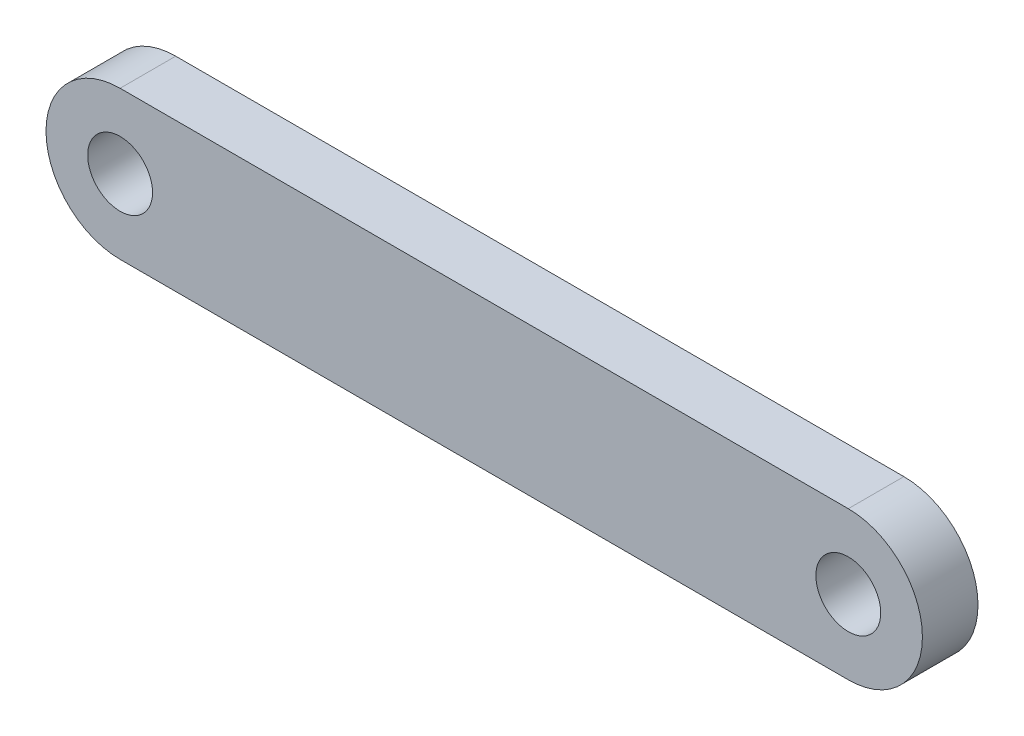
ISO-10303-21;
HEADER;
FILE_DESCRIPTION(('STEP AP214'),'2;1');
FILE_NAME('part.step','',(''),(''),'','','');
FILE_SCHEMA(('AUTOMOTIVE_DESIGN { 1 0 10303 214 1 1 1 1 }'));
ENDSEC;
DATA;
#1=APPLICATION_CONTEXT('core data for automotive mechanical design processes');
#2=APPLICATION_PROTOCOL_DEFINITION('international standard','automotive_design',2000,#1);
#3=PRODUCT_CONTEXT('',#1,'mechanical');
#4=PRODUCT('Part','Part','',(#3));
#5=PRODUCT_RELATED_PRODUCT_CATEGORY('part','',(#4));
#6=PRODUCT_DEFINITION_FORMATION('','',#4);
#7=PRODUCT_DEFINITION_CONTEXT('part definition',#1,'design');
#8=PRODUCT_DEFINITION('design','',#6,#7);
#9=PRODUCT_DEFINITION_SHAPE('','',#8);
#10=(LENGTH_UNIT() NAMED_UNIT(*) SI_UNIT(.MILLI.,.METRE.));
#11=(NAMED_UNIT(*) PLANE_ANGLE_UNIT() SI_UNIT($,.RADIAN.));
#12=(NAMED_UNIT(*) SI_UNIT($,.STERADIAN.) SOLID_ANGLE_UNIT());
#13=UNCERTAINTY_MEASURE_WITH_UNIT(LENGTH_MEASURE(1.E-05),#10,'distance_accuracy_value','');
#14=(GEOMETRIC_REPRESENTATION_CONTEXT(3) GLOBAL_UNCERTAINTY_ASSIGNED_CONTEXT((#13)) GLOBAL_UNIT_ASSIGNED_CONTEXT((#10,
#11,#12)) REPRESENTATION_CONTEXT('',''));
#15=CARTESIAN_POINT('',(0.,0.,0.));
#16=DIRECTION('',(0.,0.,1.));
#17=DIRECTION('',(1.,0.,0.));
#18=AXIS2_PLACEMENT_3D('',#15,#16,#17);
#19=CARTESIAN_POINT('',(0.,4.,3.));
#20=DIRECTION('',(0.,1.,0.));
#21=DIRECTION('',(-1.,0.,0.));
#22=AXIS2_PLACEMENT_3D('',#19,#20,#21);
#23=PLANE('',#22);
#24=DIRECTION('',(1.,0.,0.));
#25=VECTOR('',#24,1.);
#26=CARTESIAN_POINT('',(0.,4.,0.));
#27=LINE('',#26,#25);
#28=CARTESIAN_POINT('',(-39.3,4.00000000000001,0.));
#29=VERTEX_POINT('',#28);
#30=CARTESIAN_POINT('',(0.,4.,0.));
#31=VERTEX_POINT('',#30);
#32=EDGE_CURVE('E105',#29,#31,#27,.T.);
#33=ORIENTED_EDGE('',*,*,#32,.F.);
#34=DIRECTION('',(0.,0.,-1.));
#35=VECTOR('',#34,1.);
#36=CARTESIAN_POINT('',(-39.3,4.00000000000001,3.));
#37=LINE('',#36,#35);
#38=CARTESIAN_POINT('',(-39.3,4.00000000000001,3.));
#39=VERTEX_POINT('',#38);
#40=EDGE_CURVE('E11',#39,#29,#37,.T.);
#41=ORIENTED_EDGE('',*,*,#40,.F.);
#42=DIRECTION('',(1.,0.,0.));
#43=VECTOR('',#42,1.);
#44=CARTESIAN_POINT('',(0.,4.,3.));
#45=LINE('',#44,#43);
#46=CARTESIAN_POINT('',(0.,4.,3.));
#47=VERTEX_POINT('',#46);
#48=EDGE_CURVE('E91',#39,#47,#45,.T.);
#49=ORIENTED_EDGE('',*,*,#48,.T.);
#50=DIRECTION('',(0.,0.,-1.));
#51=VECTOR('',#50,1.);
#52=CARTESIAN_POINT('',(0.,4.,3.));
#53=LINE('',#52,#51);
#54=EDGE_CURVE('E73',#47,#31,#53,.T.);
#55=ORIENTED_EDGE('',*,*,#54,.T.);
#56=EDGE_LOOP('',(#33,#41,#49,#55));
#57=FACE_BOUND('',#56,.T.);
#58=ADVANCED_FACE('F34',(#57),#23,.T.);
#59=CARTESIAN_POINT('',(-39.3,0.,3.));
#60=DIRECTION('',(0.,0.,-1.));
#61=DIRECTION('',(-1.,0.,0.));
#62=AXIS2_PLACEMENT_3D('',#59,#60,#61);
#63=CYLINDRICAL_SURFACE('',#62,4.00000000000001);
#64=CARTESIAN_POINT('',(-39.3,0.,0.));
#65=DIRECTION('',(0.,0.,1.));
#66=DIRECTION('',(1.,0.,0.));
#67=AXIS2_PLACEMENT_3D('',#64,#65,#66);
#68=CIRCLE('',#67,4.00000000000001);
#69=CARTESIAN_POINT('',(-39.3,-4.00000000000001,0.));
#70=VERTEX_POINT('',#69);
#71=EDGE_CURVE('E96',#29,#70,#68,.T.);
#72=ORIENTED_EDGE('',*,*,#71,.T.);
#73=DIRECTION('',(0.,0.,-1.));
#74=VECTOR('',#73,1.);
#75=CARTESIAN_POINT('',(-39.3,-4.00000000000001,3.));
#76=LINE('',#75,#74);
#77=CARTESIAN_POINT('',(-39.3,-4.00000000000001,3.));
#78=VERTEX_POINT('',#77);
#79=EDGE_CURVE('E43',#78,#70,#76,.T.);
#80=ORIENTED_EDGE('',*,*,#79,.F.);
#81=CARTESIAN_POINT('',(-39.3,0.,3.));
#82=DIRECTION('',(0.,0.,1.));
#83=DIRECTION('',(1.,0.,0.));
#84=AXIS2_PLACEMENT_3D('',#81,#82,#83);
#85=CIRCLE('',#84,4.00000000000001);
#86=EDGE_CURVE('E88',#39,#78,#85,.T.);
#87=ORIENTED_EDGE('',*,*,#86,.F.);
#88=ORIENTED_EDGE('',*,*,#40,.T.);
#89=EDGE_LOOP('',(#72,#80,#87,#88));
#90=FACE_BOUND('',#89,.T.);
#91=ADVANCED_FACE('F94',(#90),#63,.T.);
#92=CARTESIAN_POINT('',(0.,-4.,3.));
#93=DIRECTION('',(0.,1.,0.));
#94=DIRECTION('',(-1.,0.,0.));
#95=AXIS2_PLACEMENT_3D('',#92,#93,#94);
#96=PLANE('',#95);
#97=DIRECTION('',(1.,0.,0.));
#98=VECTOR('',#97,1.);
#99=CARTESIAN_POINT('',(0.,-4.,0.));
#100=LINE('',#99,#98);
#101=CARTESIAN_POINT('',(0.,-4.,0.));
#102=VERTEX_POINT('',#101);
#103=EDGE_CURVE('E102',#70,#102,#100,.T.);
#104=ORIENTED_EDGE('',*,*,#103,.T.);
#105=DIRECTION('',(0.,0.,-1.));
#106=VECTOR('',#105,1.);
#107=CARTESIAN_POINT('',(0.,-4.,3.));
#108=LINE('',#107,#106);
#109=CARTESIAN_POINT('',(0.,-4.,3.));
#110=VERTEX_POINT('',#109);
#111=EDGE_CURVE('E87',#110,#102,#108,.T.);
#112=ORIENTED_EDGE('',*,*,#111,.F.);
#113=DIRECTION('',(1.,0.,0.));
#114=VECTOR('',#113,1.);
#115=CARTESIAN_POINT('',(0.,-4.,3.));
#116=LINE('',#115,#114);
#117=EDGE_CURVE('E81',#78,#110,#116,.T.);
#118=ORIENTED_EDGE('',*,*,#117,.F.);
#119=ORIENTED_EDGE('',*,*,#79,.T.);
#120=EDGE_LOOP('',(#104,#112,#118,#119));
#121=FACE_BOUND('',#120,.T.);
#122=ADVANCED_FACE('F84',(#121),#96,.F.);
#123=CARTESIAN_POINT('',(0.,0.,3.));
#124=DIRECTION('',(0.,0.,-1.));
#125=DIRECTION('',(-1.,0.,0.));
#126=AXIS2_PLACEMENT_3D('',#123,#124,#125);
#127=CYLINDRICAL_SURFACE('',#126,1.75);
#128=CARTESIAN_POINT('',(0.,0.,3.));
#129=DIRECTION('',(0.,0.,1.));
#130=DIRECTION('',(1.,0.,0.));
#131=AXIS2_PLACEMENT_3D('',#128,#129,#130);
#132=CIRCLE('',#131,1.75);
#133=CARTESIAN_POINT('',(1.75,0.,3.));
#134=VERTEX_POINT('',#133);
#135=EDGE_CURVE('E115',#134,#134,#132,.T.);
#136=ORIENTED_EDGE('',*,*,#135,.T.);
#137=EDGE_LOOP('',(#136));
#138=FACE_BOUND('',#137,.T.);
#139=CARTESIAN_POINT('',(0.,0.,0.));
#140=DIRECTION('',(0.,0.,1.));
#141=DIRECTION('',(1.,0.,0.));
#142=AXIS2_PLACEMENT_3D('',#139,#140,#141);
#143=CIRCLE('',#142,1.75);
#144=CARTESIAN_POINT('',(1.75,0.,0.));
#145=VERTEX_POINT('',#144);
#146=EDGE_CURVE('E107',#145,#145,#143,.T.);
#147=ORIENTED_EDGE('',*,*,#146,.F.);
#148=EDGE_LOOP('',(#147));
#149=FACE_BOUND('',#148,.T.);
#150=ADVANCED_FACE('F130',(#138,#149),#127,.F.);
#151=CARTESIAN_POINT('',(-39.3,0.,3.));
#152=DIRECTION('',(0.,0.,-1.));
#153=DIRECTION('',(-1.,0.,0.));
#154=AXIS2_PLACEMENT_3D('',#151,#152,#153);
#155=CYLINDRICAL_SURFACE('',#154,1.75);
#156=CARTESIAN_POINT('',(-39.3,0.,3.));
#157=DIRECTION('',(0.,0.,1.));
#158=DIRECTION('',(1.,0.,0.));
#159=AXIS2_PLACEMENT_3D('',#156,#157,#158);
#160=CIRCLE('',#159,1.75);
#161=CARTESIAN_POINT('',(-37.55,0.,3.));
#162=VERTEX_POINT('',#161);
#163=EDGE_CURVE('E101',#162,#162,#160,.T.);
#164=ORIENTED_EDGE('',*,*,#163,.T.);
#165=EDGE_LOOP('',(#164));
#166=FACE_BOUND('',#165,.T.);
#167=CARTESIAN_POINT('',(-39.3,0.,0.));
#168=DIRECTION('',(0.,0.,1.));
#169=DIRECTION('',(1.,0.,0.));
#170=AXIS2_PLACEMENT_3D('',#167,#168,#169);
#171=CIRCLE('',#170,1.75);
#172=CARTESIAN_POINT('',(-37.55,0.,0.));
#173=VERTEX_POINT('',#172);
#174=EDGE_CURVE('E110',#173,#173,#171,.T.);
#175=ORIENTED_EDGE('',*,*,#174,.F.);
#176=EDGE_LOOP('',(#175));
#177=FACE_BOUND('',#176,.T.);
#178=ADVANCED_FACE('F36',(#166,#177),#155,.F.);
#179=CARTESIAN_POINT('',(0.,0.,3.));
#180=DIRECTION('',(0.,0.,-1.));
#181=DIRECTION('',(-1.,0.,0.));
#182=AXIS2_PLACEMENT_3D('',#179,#180,#181);
#183=CYLINDRICAL_SURFACE('',#182,4.);
#184=CARTESIAN_POINT('',(0.,0.,0.));
#185=DIRECTION('',(0.,0.,1.));
#186=DIRECTION('',(1.,0.,0.));
#187=AXIS2_PLACEMENT_3D('',#184,#185,#186);
#188=CIRCLE('',#187,4.);
#189=EDGE_CURVE('E66',#102,#31,#188,.T.);
#190=ORIENTED_EDGE('',*,*,#189,.T.);
#191=ORIENTED_EDGE('',*,*,#54,.F.);
#192=CARTESIAN_POINT('',(0.,0.,3.));
#193=DIRECTION('',(0.,0.,1.));
#194=DIRECTION('',(1.,0.,0.));
#195=AXIS2_PLACEMENT_3D('',#192,#193,#194);
#196=CIRCLE('',#195,4.);
#197=EDGE_CURVE('E51',#110,#47,#196,.T.);
#198=ORIENTED_EDGE('',*,*,#197,.F.);
#199=ORIENTED_EDGE('',*,*,#111,.T.);
#200=EDGE_LOOP('',(#190,#191,#198,#199));
#201=FACE_BOUND('',#200,.T.);
#202=ADVANCED_FACE('F126',(#201),#183,.T.);
#203=CARTESIAN_POINT('',(0.,0.,3.));
#204=DIRECTION('',(0.,0.,1.));
#205=DIRECTION('',(1.,0.,0.));
#206=AXIS2_PLACEMENT_3D('',#203,#204,#205);
#207=PLANE('',#206);
#208=ORIENTED_EDGE('',*,*,#163,.F.);
#209=EDGE_LOOP('',(#208));
#210=FACE_BOUND('',#209,.T.);
#211=ORIENTED_EDGE('',*,*,#135,.F.);
#212=EDGE_LOOP('',(#211));
#213=FACE_BOUND('',#212,.T.);
#214=ORIENTED_EDGE('',*,*,#48,.F.);
#215=ORIENTED_EDGE('',*,*,#86,.T.);
#216=ORIENTED_EDGE('',*,*,#117,.T.);
#217=ORIENTED_EDGE('',*,*,#197,.T.);
#218=EDGE_LOOP('',(#214,#215,#216,#217));
#219=FACE_BOUND('',#218,.T.);
#220=ADVANCED_FACE('F90',(#210,#213,#219),#207,.T.);
#221=CARTESIAN_POINT('',(0.,0.,0.));
#222=DIRECTION('',(0.,0.,1.));
#223=DIRECTION('',(1.,0.,0.));
#224=AXIS2_PLACEMENT_3D('',#221,#222,#223);
#225=PLANE('',#224);
#226=ORIENTED_EDGE('',*,*,#174,.T.);
#227=EDGE_LOOP('',(#226));
#228=FACE_BOUND('',#227,.T.);
#229=ORIENTED_EDGE('',*,*,#146,.T.);
#230=EDGE_LOOP('',(#229));
#231=FACE_BOUND('',#230,.T.);
#232=ORIENTED_EDGE('',*,*,#32,.T.);
#233=ORIENTED_EDGE('',*,*,#189,.F.);
#234=ORIENTED_EDGE('',*,*,#103,.F.);
#235=ORIENTED_EDGE('',*,*,#71,.F.);
#236=EDGE_LOOP('',(#232,#233,#234,#235));
#237=FACE_BOUND('',#236,.T.);
#238=ADVANCED_FACE('F125',(#228,#231,#237),#225,.F.);
#239=CLOSED_SHELL('',(#58,#91,#122,#150,#178,#202,#220,#238));
#240=MANIFOLD_SOLID_BREP('B2',#239);
#241=ADVANCED_BREP_SHAPE_REPRESENTATION('',(#18,#240),#14);
#242=SHAPE_DEFINITION_REPRESENTATION(#9,#241);
ENDSEC;
END-ISO-10303-21;
